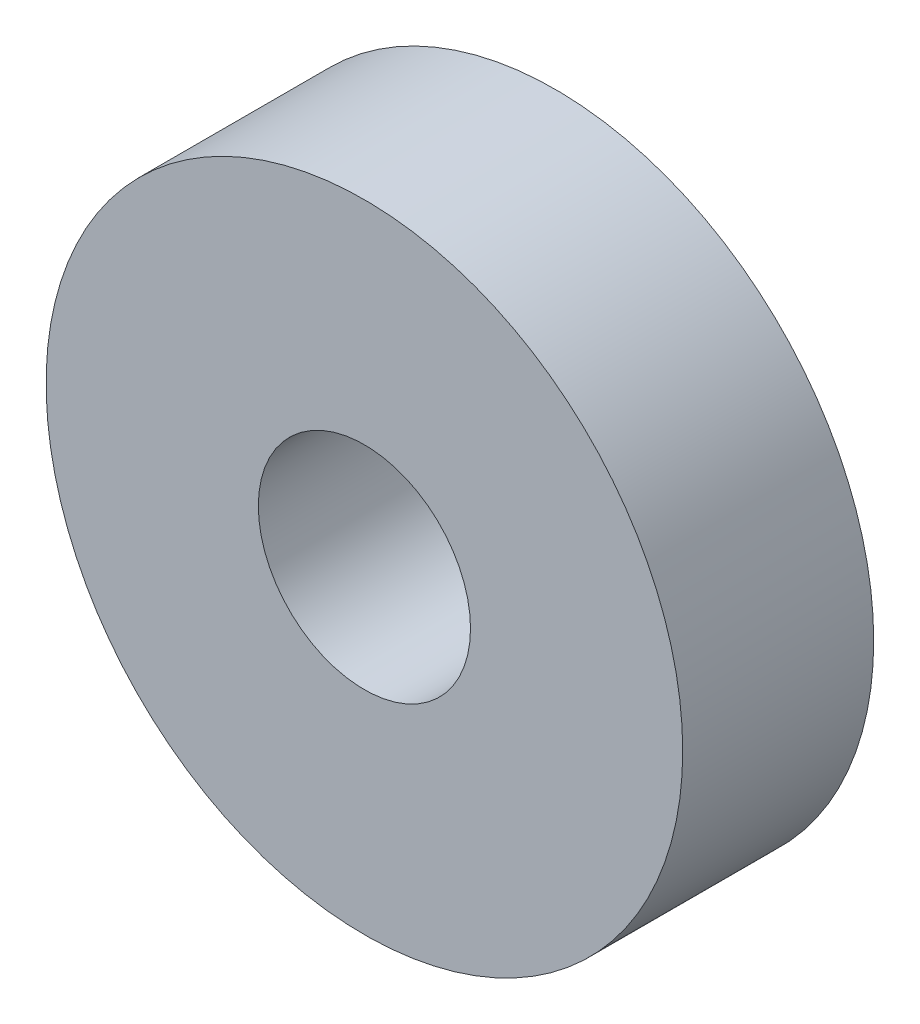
from build123d import *

# Parameters (mm, degrees)
SKETCH_1_R      = 1.5
SKETCH_1_R_2    = 0.5
EXTRUDE_1_DEPTH = 0.9


with BuildPart() as part:
    # Sketch 1 → Extrude 1 (new body)
    with BuildSketch(Plane.XY):
        Circle(SKETCH_1_R)
        Circle(SKETCH_1_R_2, mode=Mode.SUBTRACT)
    extrude(amount=EXTRUDE_1_DEPTH)


solid = part.part
